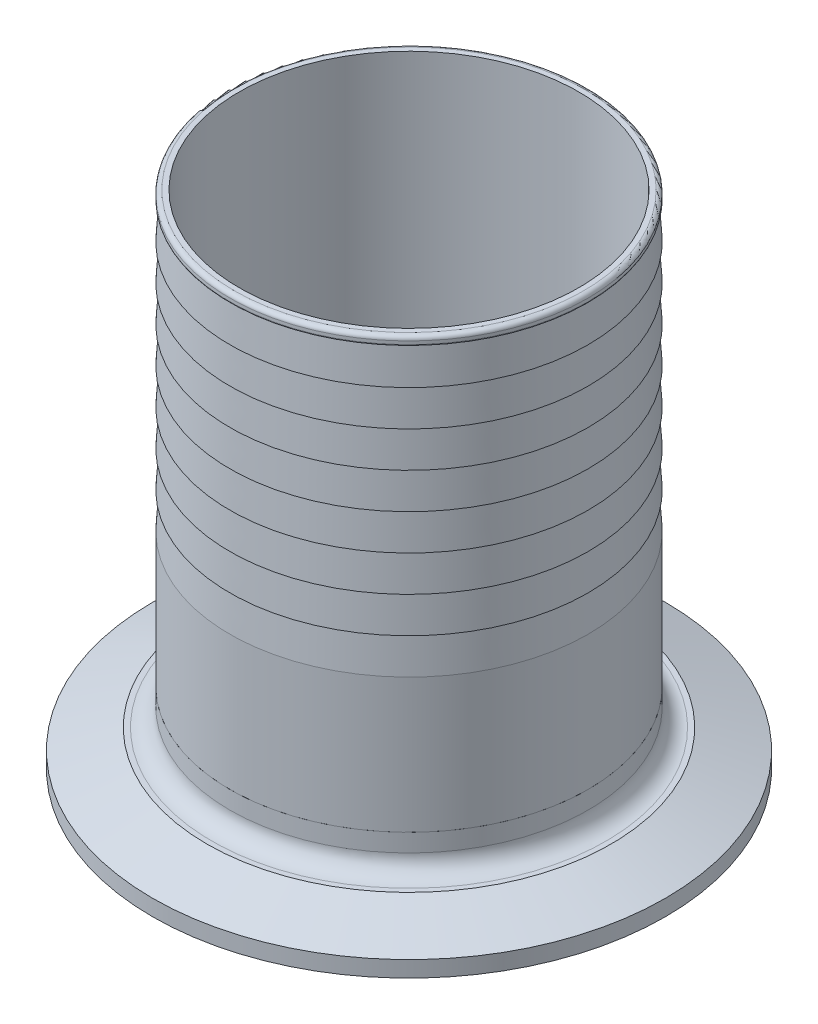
ISO-10303-21;
HEADER;
FILE_DESCRIPTION(('STEP AP214'),'2;1');
FILE_NAME('part.step','',(''),(''),'','','');
FILE_SCHEMA(('AUTOMOTIVE_DESIGN { 1 0 10303 214 1 1 1 1 }'));
ENDSEC;
DATA;
#1=APPLICATION_CONTEXT('core data for automotive mechanical design processes');
#2=APPLICATION_PROTOCOL_DEFINITION('international standard','automotive_design',2000,#1);
#3=PRODUCT_CONTEXT('',#1,'mechanical');
#4=PRODUCT('Part','Part','',(#3));
#5=PRODUCT_RELATED_PRODUCT_CATEGORY('part','',(#4));
#6=PRODUCT_DEFINITION_FORMATION('','',#4);
#7=PRODUCT_DEFINITION_CONTEXT('part definition',#1,'design');
#8=PRODUCT_DEFINITION('design','',#6,#7);
#9=PRODUCT_DEFINITION_SHAPE('','',#8);
#10=(LENGTH_UNIT() NAMED_UNIT(*) SI_UNIT(.MILLI.,.METRE.));
#11=(NAMED_UNIT(*) PLANE_ANGLE_UNIT() SI_UNIT($,.RADIAN.));
#12=(NAMED_UNIT(*) SI_UNIT($,.STERADIAN.) SOLID_ANGLE_UNIT());
#13=UNCERTAINTY_MEASURE_WITH_UNIT(LENGTH_MEASURE(1.E-05),#10,'distance_accuracy_value','');
#14=(GEOMETRIC_REPRESENTATION_CONTEXT(3) GLOBAL_UNCERTAINTY_ASSIGNED_CONTEXT((#13)) GLOBAL_UNIT_ASSIGNED_CONTEXT((#10,
#11,#12)) REPRESENTATION_CONTEXT('',''));
#15=CARTESIAN_POINT('',(0.,0.,0.));
#16=DIRECTION('',(0.,0.,1.));
#17=DIRECTION('',(1.,0.,0.));
#18=AXIS2_PLACEMENT_3D('',#15,#16,#17);
#19=CARTESIAN_POINT('',(78.5061436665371,55.9094907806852,58.4842656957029));
#20=DIRECTION('',(0.,-1.,0.));
#21=DIRECTION('',(-0.220180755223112,0.,-0.97545908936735));
#22=AXIS2_PLACEMENT_3D('',#19,#20,#21);
#23=PLANE('',#22);
#24=CARTESIAN_POINT('',(47.5353175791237,55.9094907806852,65.4750046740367));
#25=DIRECTION('',(0.,-1.,0.));
#26=DIRECTION('',(-0.220180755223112,0.,-0.97545908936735));
#27=AXIS2_PLACEMENT_3D('',#24,#25,#26);
#28=CIRCLE('',#27,30.099);
#29=CARTESIAN_POINT('',(40.9080970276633,55.9094907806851,36.1146615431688));
#30=VERTEX_POINT('',#29);
#31=EDGE_CURVE('P0_E85',#30,#30,#28,.T.);
#32=ORIENTED_EDGE('',*,*,#31,.F.);
#33=EDGE_LOOP('',(#32));
#34=FACE_BOUND('',#33,.T.);
#35=CARTESIAN_POINT('',(47.5353175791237,55.9094907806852,65.4750046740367));
#36=DIRECTION('',(0.,-1.,0.));
#37=DIRECTION('',(-0.220180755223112,0.,-0.97545908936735));
#38=AXIS2_PLACEMENT_3D('',#35,#36,#37);
#39=CIRCLE('',#38,31.75);
#40=CARTESIAN_POINT('',(40.5445786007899,55.9094907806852,34.5041785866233));
#41=VERTEX_POINT('',#40);
#42=EDGE_CURVE('P0_E9',#41,#41,#39,.T.);
#43=ORIENTED_EDGE('',*,*,#42,.T.);
#44=EDGE_LOOP('',(#43));
#45=FACE_BOUND('',#44,.T.);
#46=ADVANCED_FACE('P0_F14',(#34,#45),#23,.T.);
#47=CARTESIAN_POINT('',(47.5353175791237,55.9094907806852,65.4750046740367));
#48=DIRECTION('',(0.,-1.,0.));
#49=DIRECTION('',(-0.220180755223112,0.,-0.97545908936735));
#50=AXIS2_PLACEMENT_3D('',#47,#48,#49);
#51=CYLINDRICAL_SURFACE('',#50,31.75);
#52=CARTESIAN_POINT('',(47.5353175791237,79.7346907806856,65.4750046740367));
#53=DIRECTION('',(0.,-1.,0.));
#54=DIRECTION('',(-0.220180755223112,0.,-0.97545908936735));
#55=AXIS2_PLACEMENT_3D('',#52,#53,#54);
#56=CIRCLE('',#55,31.75);
#57=CARTESIAN_POINT('',(40.5445786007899,79.7346907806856,34.5041785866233));
#58=VERTEX_POINT('',#57);
#59=EDGE_CURVE('P0_E20',#58,#58,#56,.T.);
#60=ORIENTED_EDGE('',*,*,#59,.T.);
#61=EDGE_LOOP('',(#60));
#62=FACE_BOUND('',#61,.T.);
#63=ORIENTED_EDGE('',*,*,#42,.F.);
#64=EDGE_LOOP('',(#63));
#65=FACE_BOUND('',#64,.T.);
#66=ADVANCED_FACE('P0_F101',(#62,#65),#51,.T.);
#67=CARTESIAN_POINT('',(47.5353175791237,79.7346907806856,65.4750046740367));
#68=DIRECTION('',(0.,-1.,0.));
#69=DIRECTION('',(-0.220180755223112,0.,-0.97545908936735));
#70=AXIS2_PLACEMENT_3D('',#67,#68,#69);
#71=CONICAL_SURFACE('',#70,31.75,0.0599281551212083);
#72=CARTESIAN_POINT('',(47.5353175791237,86.0846907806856,65.4750046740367));
#73=DIRECTION('',(0.,-1.,0.));
#74=DIRECTION('',(-0.220180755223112,0.,-0.97545908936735));
#75=AXIS2_PLACEMENT_3D('',#72,#73,#74);
#76=CIRCLE('',#75,31.369);
#77=CARTESIAN_POINT('',(40.6284674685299,86.0846907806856,34.8758284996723));
#78=VERTEX_POINT('',#77);
#79=EDGE_CURVE('P0_E24',#78,#78,#76,.T.);
#80=ORIENTED_EDGE('',*,*,#79,.T.);
#81=EDGE_LOOP('',(#80));
#82=FACE_BOUND('',#81,.T.);
#83=ORIENTED_EDGE('',*,*,#59,.F.);
#84=EDGE_LOOP('',(#83));
#85=FACE_BOUND('',#84,.T.);
#86=ADVANCED_FACE('P0_F106',(#82,#85),#71,.T.);
#87=CARTESIAN_POINT('',(78.5061436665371,86.0846907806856,58.4842656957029));
#88=DIRECTION('',(0.,-1.,0.));
#89=DIRECTION('',(-0.220180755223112,0.,-0.97545908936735));
#90=AXIS2_PLACEMENT_3D('',#87,#88,#89);
#91=PLANE('',#90);
#92=CARTESIAN_POINT('',(47.5353175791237,86.0846907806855,65.4750046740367));
#93=DIRECTION('',(0.,-1.,0.));
#94=DIRECTION('',(-0.220180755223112,0.,-0.97545908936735));
#95=AXIS2_PLACEMENT_3D('',#92,#93,#94);
#96=CIRCLE('',#95,31.75);
#97=CARTESIAN_POINT('',(40.5445786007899,86.0846907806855,34.5041785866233));
#98=VERTEX_POINT('',#97);
#99=EDGE_CURVE('P0_E28',#98,#98,#96,.T.);
#100=ORIENTED_EDGE('',*,*,#99,.T.);
#101=EDGE_LOOP('',(#100));
#102=FACE_BOUND('',#101,.T.);
#103=ORIENTED_EDGE('',*,*,#79,.F.);
#104=EDGE_LOOP('',(#103));
#105=FACE_BOUND('',#104,.T.);
#106=ADVANCED_FACE('P0_F110',(#102,#105),#91,.T.);
#107=CARTESIAN_POINT('',(47.5353175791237,86.0846907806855,65.4750046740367));
#108=DIRECTION('',(0.,-1.,0.));
#109=DIRECTION('',(-0.220180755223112,0.,-0.97545908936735));
#110=AXIS2_PLACEMENT_3D('',#107,#108,#109);
#111=CONICAL_SURFACE('',#110,31.75,0.0599281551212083);
#112=CARTESIAN_POINT('',(47.5353175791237,92.4346907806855,65.4750046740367));
#113=DIRECTION('',(0.,-1.,0.));
#114=DIRECTION('',(-0.220180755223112,0.,-0.97545908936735));
#115=AXIS2_PLACEMENT_3D('',#112,#113,#114);
#116=CIRCLE('',#115,31.369);
#117=CARTESIAN_POINT('',(40.6284674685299,92.4346907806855,34.8758284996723));
#118=VERTEX_POINT('',#117);
#119=EDGE_CURVE('P0_E33',#118,#118,#116,.T.);
#120=ORIENTED_EDGE('',*,*,#119,.T.);
#121=EDGE_LOOP('',(#120));
#122=FACE_BOUND('',#121,.T.);
#123=ORIENTED_EDGE('',*,*,#99,.F.);
#124=EDGE_LOOP('',(#123));
#125=FACE_BOUND('',#124,.T.);
#126=ADVANCED_FACE('P0_F117',(#122,#125),#111,.T.);
#127=CARTESIAN_POINT('',(78.5061436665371,92.4346907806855,58.4842656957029));
#128=DIRECTION('',(0.,-1.,0.));
#129=DIRECTION('',(-0.220180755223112,0.,-0.97545908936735));
#130=AXIS2_PLACEMENT_3D('',#127,#128,#129);
#131=PLANE('',#130);
#132=CARTESIAN_POINT('',(47.5353175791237,92.4346907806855,65.4750046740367));
#133=DIRECTION('',(0.,-1.,0.));
#134=DIRECTION('',(-0.220180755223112,0.,-0.97545908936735));
#135=AXIS2_PLACEMENT_3D('',#132,#133,#134);
#136=CIRCLE('',#135,31.75);
#137=CARTESIAN_POINT('',(40.5445786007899,92.4346907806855,34.5041785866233));
#138=VERTEX_POINT('',#137);
#139=EDGE_CURVE('P0_E36',#138,#138,#136,.T.);
#140=ORIENTED_EDGE('',*,*,#139,.T.);
#141=EDGE_LOOP('',(#140));
#142=FACE_BOUND('',#141,.T.);
#143=ORIENTED_EDGE('',*,*,#119,.F.);
#144=EDGE_LOOP('',(#143));
#145=FACE_BOUND('',#144,.T.);
#146=ADVANCED_FACE('P0_F121',(#142,#145),#131,.T.);
#147=CARTESIAN_POINT('',(47.5353175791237,92.4346907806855,65.4750046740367));
#148=DIRECTION('',(0.,-1.,0.));
#149=DIRECTION('',(-0.220180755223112,0.,-0.97545908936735));
#150=AXIS2_PLACEMENT_3D('',#147,#148,#149);
#151=CONICAL_SURFACE('',#150,31.75,0.0599281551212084);
#152=CARTESIAN_POINT('',(47.5353175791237,98.7846907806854,65.4750046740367));
#153=DIRECTION('',(0.,-1.,0.));
#154=DIRECTION('',(-0.220180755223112,0.,-0.97545908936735));
#155=AXIS2_PLACEMENT_3D('',#152,#153,#154);
#156=CIRCLE('',#155,31.369);
#157=CARTESIAN_POINT('',(40.6284674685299,98.7846907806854,34.8758284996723));
#158=VERTEX_POINT('',#157);
#159=EDGE_CURVE('P0_E39',#158,#158,#156,.T.);
#160=ORIENTED_EDGE('',*,*,#159,.T.);
#161=EDGE_LOOP('',(#160));
#162=FACE_BOUND('',#161,.T.);
#163=ORIENTED_EDGE('',*,*,#139,.F.);
#164=EDGE_LOOP('',(#163));
#165=FACE_BOUND('',#164,.T.);
#166=ADVANCED_FACE('P0_F125',(#162,#165),#151,.T.);
#167=CARTESIAN_POINT('',(78.506143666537,98.7846907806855,58.4842656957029));
#168=DIRECTION('',(0.,-1.,0.));
#169=DIRECTION('',(-0.220180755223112,0.,-0.97545908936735));
#170=AXIS2_PLACEMENT_3D('',#167,#168,#169);
#171=PLANE('',#170);
#172=CARTESIAN_POINT('',(47.5353175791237,98.7846907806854,65.4750046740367));
#173=DIRECTION('',(0.,-1.,0.));
#174=DIRECTION('',(-0.220180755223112,0.,-0.97545908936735));
#175=AXIS2_PLACEMENT_3D('',#172,#173,#174);
#176=CIRCLE('',#175,31.75);
#177=CARTESIAN_POINT('',(40.5445786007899,98.7846907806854,34.5041785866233));
#178=VERTEX_POINT('',#177);
#179=EDGE_CURVE('P0_E42',#178,#178,#176,.T.);
#180=ORIENTED_EDGE('',*,*,#179,.T.);
#181=EDGE_LOOP('',(#180));
#182=FACE_BOUND('',#181,.T.);
#183=ORIENTED_EDGE('',*,*,#159,.F.);
#184=EDGE_LOOP('',(#183));
#185=FACE_BOUND('',#184,.T.);
#186=ADVANCED_FACE('P0_F129',(#182,#185),#171,.T.);
#187=CARTESIAN_POINT('',(47.5353175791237,98.7846907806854,65.4750046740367));
#188=DIRECTION('',(0.,-1.,0.));
#189=DIRECTION('',(-0.220180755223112,0.,-0.97545908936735));
#190=AXIS2_PLACEMENT_3D('',#187,#188,#189);
#191=CONICAL_SURFACE('',#190,31.75,0.0599281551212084);
#192=CARTESIAN_POINT('',(47.5353175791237,105.134690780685,65.4750046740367));
#193=DIRECTION('',(0.,-1.,0.));
#194=DIRECTION('',(-0.220180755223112,0.,-0.97545908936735));
#195=AXIS2_PLACEMENT_3D('',#192,#193,#194);
#196=CIRCLE('',#195,31.369);
#197=CARTESIAN_POINT('',(40.6284674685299,105.134690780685,34.8758284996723));
#198=VERTEX_POINT('',#197);
#199=EDGE_CURVE('P0_E45',#198,#198,#196,.T.);
#200=ORIENTED_EDGE('',*,*,#199,.T.);
#201=EDGE_LOOP('',(#200));
#202=FACE_BOUND('',#201,.T.);
#203=ORIENTED_EDGE('',*,*,#179,.F.);
#204=EDGE_LOOP('',(#203));
#205=FACE_BOUND('',#204,.T.);
#206=ADVANCED_FACE('P0_F133',(#202,#205),#191,.T.);
#207=CARTESIAN_POINT('',(78.506143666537,105.134690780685,58.4842656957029));
#208=DIRECTION('',(0.,-1.,0.));
#209=DIRECTION('',(-0.220180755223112,0.,-0.97545908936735));
#210=AXIS2_PLACEMENT_3D('',#207,#208,#209);
#211=PLANE('',#210);
#212=CARTESIAN_POINT('',(47.5353175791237,105.134690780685,65.4750046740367));
#213=DIRECTION('',(0.,-1.,0.));
#214=DIRECTION('',(-0.220180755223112,0.,-0.97545908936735));
#215=AXIS2_PLACEMENT_3D('',#212,#213,#214);
#216=CIRCLE('',#215,31.75);
#217=CARTESIAN_POINT('',(40.5445786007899,105.134690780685,34.5041785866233));
#218=VERTEX_POINT('',#217);
#219=EDGE_CURVE('P0_E48',#218,#218,#216,.T.);
#220=ORIENTED_EDGE('',*,*,#219,.T.);
#221=EDGE_LOOP('',(#220));
#222=FACE_BOUND('',#221,.T.);
#223=ORIENTED_EDGE('',*,*,#199,.F.);
#224=EDGE_LOOP('',(#223));
#225=FACE_BOUND('',#224,.T.);
#226=ADVANCED_FACE('P0_F137',(#222,#225),#211,.T.);
#227=CARTESIAN_POINT('',(47.5353175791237,105.134690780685,65.4750046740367));
#228=DIRECTION('',(0.,-1.,0.));
#229=DIRECTION('',(-0.220180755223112,0.,-0.97545908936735));
#230=AXIS2_PLACEMENT_3D('',#227,#228,#229);
#231=CONICAL_SURFACE('',#230,31.75,0.0599281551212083);
#232=CARTESIAN_POINT('',(47.5353175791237,111.484690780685,65.4750046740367));
#233=DIRECTION('',(0.,-1.,0.));
#234=DIRECTION('',(-0.220180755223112,0.,-0.97545908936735));
#235=AXIS2_PLACEMENT_3D('',#232,#233,#234);
#236=CIRCLE('',#235,31.369);
#237=CARTESIAN_POINT('',(40.6284674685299,111.484690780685,34.8758284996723));
#238=VERTEX_POINT('',#237);
#239=EDGE_CURVE('P0_E51',#238,#238,#236,.T.);
#240=ORIENTED_EDGE('',*,*,#239,.T.);
#241=EDGE_LOOP('',(#240));
#242=FACE_BOUND('',#241,.T.);
#243=ORIENTED_EDGE('',*,*,#219,.F.);
#244=EDGE_LOOP('',(#243));
#245=FACE_BOUND('',#244,.T.);
#246=ADVANCED_FACE('P0_F141',(#242,#245),#231,.T.);
#247=CARTESIAN_POINT('',(78.506143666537,111.484690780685,58.4842656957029));
#248=DIRECTION('',(0.,-1.,0.));
#249=DIRECTION('',(-0.220180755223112,0.,-0.97545908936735));
#250=AXIS2_PLACEMENT_3D('',#247,#248,#249);
#251=PLANE('',#250);
#252=CARTESIAN_POINT('',(47.5353175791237,111.484690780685,65.4750046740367));
#253=DIRECTION('',(0.,-1.,0.));
#254=DIRECTION('',(-0.220180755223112,0.,-0.97545908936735));
#255=AXIS2_PLACEMENT_3D('',#252,#253,#254);
#256=CIRCLE('',#255,31.75);
#257=CARTESIAN_POINT('',(40.5445786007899,111.484690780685,34.5041785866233));
#258=VERTEX_POINT('',#257);
#259=EDGE_CURVE('P0_E54',#258,#258,#256,.T.);
#260=ORIENTED_EDGE('',*,*,#259,.T.);
#261=EDGE_LOOP('',(#260));
#262=FACE_BOUND('',#261,.T.);
#263=ORIENTED_EDGE('',*,*,#239,.F.);
#264=EDGE_LOOP('',(#263));
#265=FACE_BOUND('',#264,.T.);
#266=ADVANCED_FACE('P0_F145',(#262,#265),#251,.T.);
#267=CARTESIAN_POINT('',(47.5353175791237,111.484690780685,65.4750046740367));
#268=DIRECTION('',(0.,-1.,0.));
#269=DIRECTION('',(-0.220180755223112,0.,-0.97545908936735));
#270=AXIS2_PLACEMENT_3D('',#267,#268,#269);
#271=CONICAL_SURFACE('',#270,31.75,0.0599281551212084);
#272=CARTESIAN_POINT('',(47.5353175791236,117.834690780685,65.4750046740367));
#273=DIRECTION('',(0.,-1.,0.));
#274=DIRECTION('',(-0.220180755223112,0.,-0.97545908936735));
#275=AXIS2_PLACEMENT_3D('',#272,#273,#274);
#276=CIRCLE('',#275,31.369);
#277=CARTESIAN_POINT('',(40.6284674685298,117.834690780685,34.8758284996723));
#278=VERTEX_POINT('',#277);
#279=EDGE_CURVE('P0_E57',#278,#278,#276,.T.);
#280=ORIENTED_EDGE('',*,*,#279,.T.);
#281=EDGE_LOOP('',(#280));
#282=FACE_BOUND('',#281,.T.);
#283=ORIENTED_EDGE('',*,*,#259,.F.);
#284=EDGE_LOOP('',(#283));
#285=FACE_BOUND('',#284,.T.);
#286=ADVANCED_FACE('P0_F149',(#282,#285),#271,.T.);
#287=CARTESIAN_POINT('',(78.506143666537,117.834690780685,58.4842656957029));
#288=DIRECTION('',(0.,-1.,0.));
#289=DIRECTION('',(-0.220180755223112,0.,-0.97545908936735));
#290=AXIS2_PLACEMENT_3D('',#287,#288,#289);
#291=PLANE('',#290);
#292=CARTESIAN_POINT('',(47.5353175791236,117.834690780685,65.4750046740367));
#293=DIRECTION('',(0.,-1.,0.));
#294=DIRECTION('',(-0.220180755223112,0.,-0.97545908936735));
#295=AXIS2_PLACEMENT_3D('',#292,#293,#294);
#296=CIRCLE('',#295,31.75);
#297=CARTESIAN_POINT('',(40.5445786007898,117.834690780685,34.5041785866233));
#298=VERTEX_POINT('',#297);
#299=EDGE_CURVE('P0_E60',#298,#298,#296,.T.);
#300=ORIENTED_EDGE('',*,*,#299,.T.);
#301=EDGE_LOOP('',(#300));
#302=FACE_BOUND('',#301,.T.);
#303=ORIENTED_EDGE('',*,*,#279,.F.);
#304=EDGE_LOOP('',(#303));
#305=FACE_BOUND('',#304,.T.);
#306=ADVANCED_FACE('P0_F153',(#302,#305),#291,.T.);
#307=CARTESIAN_POINT('',(47.5353175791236,117.834690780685,65.4750046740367));
#308=DIRECTION('',(0.,-1.,0.));
#309=DIRECTION('',(-0.220180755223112,0.,-0.97545908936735));
#310=AXIS2_PLACEMENT_3D('',#307,#308,#309);
#311=CONICAL_SURFACE('',#310,31.75,0.0599281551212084);
#312=CARTESIAN_POINT('',(47.5353175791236,124.184690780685,65.4750046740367));
#313=DIRECTION('',(0.,-1.,0.));
#314=DIRECTION('',(-0.220180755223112,0.,-0.97545908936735));
#315=AXIS2_PLACEMENT_3D('',#312,#313,#314);
#316=CIRCLE('',#315,31.369);
#317=CARTESIAN_POINT('',(40.6284674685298,124.184690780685,34.8758284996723));
#318=VERTEX_POINT('',#317);
#319=EDGE_CURVE('P0_E63',#318,#318,#316,.T.);
#320=ORIENTED_EDGE('',*,*,#319,.T.);
#321=EDGE_LOOP('',(#320));
#322=FACE_BOUND('',#321,.T.);
#323=ORIENTED_EDGE('',*,*,#299,.F.);
#324=EDGE_LOOP('',(#323));
#325=FACE_BOUND('',#324,.T.);
#326=ADVANCED_FACE('P0_F157',(#322,#325),#311,.T.);
#327=CARTESIAN_POINT('',(78.506143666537,124.184690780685,58.4842656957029));
#328=DIRECTION('',(0.,-1.,0.));
#329=DIRECTION('',(-0.220180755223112,0.,-0.97545908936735));
#330=AXIS2_PLACEMENT_3D('',#327,#328,#329);
#331=PLANE('',#330);
#332=CARTESIAN_POINT('',(47.5353175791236,124.184690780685,65.4750046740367));
#333=DIRECTION('',(0.,-1.,0.));
#334=DIRECTION('',(-0.220180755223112,0.,-0.97545908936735));
#335=AXIS2_PLACEMENT_3D('',#332,#333,#334);
#336=CIRCLE('',#335,31.75);
#337=CARTESIAN_POINT('',(40.5445786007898,124.184690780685,34.5041785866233));
#338=VERTEX_POINT('',#337);
#339=EDGE_CURVE('P0_E66',#338,#338,#336,.T.);
#340=ORIENTED_EDGE('',*,*,#339,.T.);
#341=EDGE_LOOP('',(#340));
#342=FACE_BOUND('',#341,.T.);
#343=ORIENTED_EDGE('',*,*,#319,.F.);
#344=EDGE_LOOP('',(#343));
#345=FACE_BOUND('',#344,.T.);
#346=ADVANCED_FACE('P0_F161',(#342,#345),#331,.T.);
#347=CARTESIAN_POINT('',(47.5353175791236,124.184690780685,65.4750046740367));
#348=DIRECTION('',(0.,-1.,0.));
#349=DIRECTION('',(-0.220180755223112,0.,-0.97545908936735));
#350=AXIS2_PLACEMENT_3D('',#347,#348,#349);
#351=CONICAL_SURFACE('',#350,31.75,0.0599281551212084);
#352=CARTESIAN_POINT('',(47.5353175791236,130.534690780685,65.4750046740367));
#353=DIRECTION('',(0.,-1.,0.));
#354=DIRECTION('',(-0.220180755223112,0.,-0.97545908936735));
#355=AXIS2_PLACEMENT_3D('',#352,#353,#354);
#356=CIRCLE('',#355,31.369);
#357=CARTESIAN_POINT('',(40.6284674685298,130.534690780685,34.8758284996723));
#358=VERTEX_POINT('',#357);
#359=EDGE_CURVE('P0_E69',#358,#358,#356,.T.);
#360=ORIENTED_EDGE('',*,*,#359,.T.);
#361=EDGE_LOOP('',(#360));
#362=FACE_BOUND('',#361,.T.);
#363=ORIENTED_EDGE('',*,*,#339,.F.);
#364=EDGE_LOOP('',(#363));
#365=FACE_BOUND('',#364,.T.);
#366=ADVANCED_FACE('P0_F165',(#362,#365),#351,.T.);
#367=CARTESIAN_POINT('',(78.2583770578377,130.534690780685,58.5401916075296));
#368=DIRECTION('',(0.,-1.,0.));
#369=DIRECTION('',(-0.220180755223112,0.,-0.97545908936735));
#370=AXIS2_PLACEMENT_3D('',#367,#368,#369);
#371=PLANE('',#370);
#372=CARTESIAN_POINT('',(47.5353175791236,130.534690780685,65.4750046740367));
#373=DIRECTION('',(0.,-1.,0.));
#374=DIRECTION('',(-0.220180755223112,0.,-0.97545908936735));
#375=AXIS2_PLACEMENT_3D('',#372,#373,#374);
#376=CIRCLE('',#375,31.496);
#377=CARTESIAN_POINT('',(40.6005045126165,130.534690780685,34.7519451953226));
#378=VERTEX_POINT('',#377);
#379=EDGE_CURVE('P0_E72',#378,#378,#376,.T.);
#380=ORIENTED_EDGE('',*,*,#379,.T.);
#381=EDGE_LOOP('',(#380));
#382=FACE_BOUND('',#381,.T.);
#383=ORIENTED_EDGE('',*,*,#359,.F.);
#384=EDGE_LOOP('',(#383));
#385=FACE_BOUND('',#384,.T.);
#386=ADVANCED_FACE('P0_F169',(#382,#385),#371,.T.);
#387=CARTESIAN_POINT('',(47.5353175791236,130.788690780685,65.4750046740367));
#388=DIRECTION('',(0.,-1.,0.));
#389=DIRECTION('',(-0.220180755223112,0.,-0.97545908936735));
#390=AXIS2_PLACEMENT_3D('',#387,#388,#389);
#391=TOROIDAL_SURFACE('',#390,31.496,0.254000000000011);
#392=CARTESIAN_POINT('',(47.5353175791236,130.788690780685,65.4750046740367));
#393=DIRECTION('',(0.,-1.,0.));
#394=DIRECTION('',(-0.220180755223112,0.,-0.97545908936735));
#395=AXIS2_PLACEMENT_3D('',#392,#393,#394);
#396=CIRCLE('',#395,31.75);
#397=CARTESIAN_POINT('',(40.5445786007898,130.788690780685,34.5041785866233));
#398=VERTEX_POINT('',#397);
#399=EDGE_CURVE('P0_E75',#398,#398,#396,.T.);
#400=ORIENTED_EDGE('',*,*,#399,.T.);
#401=EDGE_LOOP('',(#400));
#402=FACE_BOUND('',#401,.T.);
#403=ORIENTED_EDGE('',*,*,#379,.F.);
#404=EDGE_LOOP('',(#403));
#405=FACE_BOUND('',#404,.T.);
#406=ADVANCED_FACE('P0_F173',(#402,#405),#391,.T.);
#407=CARTESIAN_POINT('',(47.5353175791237,55.9094907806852,65.4750046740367));
#408=DIRECTION('',(0.,-1.,0.));
#409=DIRECTION('',(-0.220180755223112,0.,-0.97545908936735));
#410=AXIS2_PLACEMENT_3D('',#407,#408,#409);
#411=CYLINDRICAL_SURFACE('',#410,31.75);
#412=CARTESIAN_POINT('',(47.5353175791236,131.347490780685,65.4750046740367));
#413=DIRECTION('',(0.,-1.,0.));
#414=DIRECTION('',(-0.220180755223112,0.,-0.97545908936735));
#415=AXIS2_PLACEMENT_3D('',#412,#413,#414);
#416=CIRCLE('',#415,31.75);
#417=CARTESIAN_POINT('',(40.5445786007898,131.347490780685,34.5041785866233));
#418=VERTEX_POINT('',#417);
#419=EDGE_CURVE('P0_E78',#418,#418,#416,.T.);
#420=ORIENTED_EDGE('',*,*,#419,.T.);
#421=EDGE_LOOP('',(#420));
#422=FACE_BOUND('',#421,.T.);
#423=ORIENTED_EDGE('',*,*,#399,.F.);
#424=EDGE_LOOP('',(#423));
#425=FACE_BOUND('',#424,.T.);
#426=ADVANCED_FACE('P0_F177',(#422,#425),#411,.T.);
#427=CARTESIAN_POINT('',(47.5353175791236,131.347490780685,65.4750046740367));
#428=DIRECTION('',(0.,-1.,0.));
#429=DIRECTION('',(-0.220180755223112,0.,-0.97545908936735));
#430=AXIS2_PLACEMENT_3D('',#427,#428,#429);
#431=TOROIDAL_SURFACE('',#430,30.988,0.761999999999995);
#432=CARTESIAN_POINT('',(47.5353175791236,132.109490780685,65.4750046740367));
#433=DIRECTION('',(0.,-1.,0.));
#434=DIRECTION('',(-0.220180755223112,0.,-0.97545908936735));
#435=AXIS2_PLACEMENT_3D('',#432,#433,#434);
#436=CIRCLE('',#435,30.988);
#437=CARTESIAN_POINT('',(40.7123563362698,132.109490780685,35.2474784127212));
#438=VERTEX_POINT('',#437);
#439=EDGE_CURVE('P0_E81',#438,#438,#436,.T.);
#440=ORIENTED_EDGE('',*,*,#439,.T.);
#441=EDGE_LOOP('',(#440));
#442=FACE_BOUND('',#441,.T.);
#443=ORIENTED_EDGE('',*,*,#419,.F.);
#444=EDGE_LOOP('',(#443));
#445=FACE_BOUND('',#444,.T.);
#446=ADVANCED_FACE('P0_F181',(#442,#445),#431,.T.);
#447=CARTESIAN_POINT('',(47.5353175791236,132.109490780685,65.4750046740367));
#448=DIRECTION('',(0.,1.,0.));
#449=DIRECTION('',(0.220180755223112,0.,0.97545908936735));
#450=AXIS2_PLACEMENT_3D('',#447,#448,#449);
#451=PLANE('',#450);
#452=CARTESIAN_POINT('',(47.5353175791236,132.109490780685,65.4750046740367));
#453=DIRECTION('',(0.,-1.,0.));
#454=DIRECTION('',(-0.220180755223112,0.,-0.97545908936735));
#455=AXIS2_PLACEMENT_3D('',#452,#453,#454);
#456=CIRCLE('',#455,30.099);
#457=CARTESIAN_POINT('',(40.9080970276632,132.109490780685,36.1146615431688));
#458=VERTEX_POINT('',#457);
#459=EDGE_CURVE('P0_E84',#458,#458,#456,.T.);
#460=ORIENTED_EDGE('',*,*,#459,.T.);
#461=EDGE_LOOP('',(#460));
#462=FACE_BOUND('',#461,.T.);
#463=ORIENTED_EDGE('',*,*,#439,.F.);
#464=EDGE_LOOP('',(#463));
#465=FACE_BOUND('',#464,.T.);
#466=ADVANCED_FACE('P0_F91',(#462,#465),#451,.T.);
#467=CARTESIAN_POINT('',(47.5353175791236,132.109490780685,65.4750046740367));
#468=DIRECTION('',(0.,-1.,0.));
#469=DIRECTION('',(-0.220180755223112,0.,-0.97545908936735));
#470=AXIS2_PLACEMENT_3D('',#467,#468,#469);
#471=CYLINDRICAL_SURFACE('',#470,30.099);
#472=CARTESIAN_POINT('',(40.9080970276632,132.109490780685,36.1146615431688));
#473=CARTESIAN_POINT('',(40.9080970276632,131.315740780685,36.1146615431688));
#474=CARTESIAN_POINT('',(40.9080970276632,130.521990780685,36.1146615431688));
#475=CARTESIAN_POINT('',(40.9080970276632,128.934490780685,36.1146615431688));
#476=CARTESIAN_POINT('',(40.9080970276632,128.140740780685,36.1146615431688));
#477=CARTESIAN_POINT('',(40.9080970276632,126.553240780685,36.1146615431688));
#478=CARTESIAN_POINT('',(40.9080970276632,125.759490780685,36.1146615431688));
#479=CARTESIAN_POINT('',(40.9080970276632,124.171990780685,36.1146615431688));
#480=CARTESIAN_POINT('',(40.9080970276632,123.378240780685,36.1146615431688));
#481=CARTESIAN_POINT('',(40.9080970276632,121.790740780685,36.1146615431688));
#482=CARTESIAN_POINT('',(40.9080970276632,120.996990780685,36.1146615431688));
#483=CARTESIAN_POINT('',(40.9080970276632,119.409490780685,36.1146615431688));
#484=CARTESIAN_POINT('',(40.9080970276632,118.615740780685,36.1146615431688));
#485=CARTESIAN_POINT('',(40.9080970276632,117.028240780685,36.1146615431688));
#486=CARTESIAN_POINT('',(40.9080970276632,116.234490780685,36.1146615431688));
#487=CARTESIAN_POINT('',(40.9080970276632,114.646990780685,36.1146615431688));
#488=CARTESIAN_POINT('',(40.9080970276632,113.853240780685,36.1146615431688));
#489=CARTESIAN_POINT('',(40.9080970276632,112.265740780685,36.1146615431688));
#490=CARTESIAN_POINT('',(40.9080970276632,111.471990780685,36.1146615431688));
#491=CARTESIAN_POINT('',(40.9080970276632,109.884490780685,36.1146615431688));
#492=CARTESIAN_POINT('',(40.9080970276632,109.090740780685,36.1146615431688));
#493=CARTESIAN_POINT('',(40.9080970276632,107.503240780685,36.1146615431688));
#494=CARTESIAN_POINT('',(40.9080970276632,106.709490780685,36.1146615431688));
#495=CARTESIAN_POINT('',(40.9080970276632,105.121990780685,36.1146615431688));
#496=CARTESIAN_POINT('',(40.9080970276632,104.328240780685,36.1146615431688));
#497=CARTESIAN_POINT('',(40.9080970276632,102.740740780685,36.1146615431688));
#498=CARTESIAN_POINT('',(40.9080970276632,101.946990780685,36.1146615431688));
#499=CARTESIAN_POINT('',(40.9080970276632,100.359490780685,36.1146615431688));
#500=CARTESIAN_POINT('',(40.9080970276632,99.5657407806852,36.1146615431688));
#501=CARTESIAN_POINT('',(40.9080970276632,97.9782407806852,36.1146615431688));
#502=CARTESIAN_POINT('',(40.9080970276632,97.1844907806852,36.1146615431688));
#503=CARTESIAN_POINT('',(40.9080970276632,95.5969907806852,36.1146615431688));
#504=CARTESIAN_POINT('',(40.9080970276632,94.8032407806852,36.1146615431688));
#505=CARTESIAN_POINT('',(40.9080970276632,93.2157407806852,36.1146615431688));
#506=CARTESIAN_POINT('',(40.9080970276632,92.4219907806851,36.1146615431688));
#507=CARTESIAN_POINT('',(40.9080970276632,90.8344907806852,36.1146615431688));
#508=CARTESIAN_POINT('',(40.9080970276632,90.0407407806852,36.1146615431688));
#509=CARTESIAN_POINT('',(40.9080970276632,88.4532407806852,36.1146615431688));
#510=CARTESIAN_POINT('',(40.9080970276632,87.6594907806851,36.1146615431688));
#511=CARTESIAN_POINT('',(40.9080970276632,86.0719907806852,36.1146615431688));
#512=CARTESIAN_POINT('',(40.9080970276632,85.2782407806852,36.1146615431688));
#513=CARTESIAN_POINT('',(40.9080970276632,83.6907407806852,36.1146615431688));
#514=CARTESIAN_POINT('',(40.9080970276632,82.8969907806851,36.1146615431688));
#515=CARTESIAN_POINT('',(40.9080970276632,81.3094907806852,36.1146615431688));
#516=CARTESIAN_POINT('',(40.9080970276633,80.5157407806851,36.1146615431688));
#517=CARTESIAN_POINT('',(40.9080970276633,78.9282407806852,36.1146615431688));
#518=CARTESIAN_POINT('',(40.9080970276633,78.1344907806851,36.1146615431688));
#519=CARTESIAN_POINT('',(40.9080970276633,76.5469907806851,36.1146615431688));
#520=CARTESIAN_POINT('',(40.9080970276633,75.7532407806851,36.1146615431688));
#521=CARTESIAN_POINT('',(40.9080970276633,74.1657407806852,36.1146615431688));
#522=CARTESIAN_POINT('',(40.9080970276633,73.3719907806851,36.1146615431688));
#523=CARTESIAN_POINT('',(40.9080970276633,71.7844907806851,36.1146615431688));
#524=CARTESIAN_POINT('',(40.9080970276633,70.9907407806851,36.1146615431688));
#525=CARTESIAN_POINT('',(40.9080970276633,69.4032407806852,36.1146615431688));
#526=CARTESIAN_POINT('',(40.9080970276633,68.6094907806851,36.1146615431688));
#527=CARTESIAN_POINT('',(40.9080970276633,67.0219907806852,36.1146615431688));
#528=CARTESIAN_POINT('',(40.9080970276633,66.2282407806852,36.1146615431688));
#529=CARTESIAN_POINT('',(40.9080970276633,64.6407407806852,36.1146615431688));
#530=CARTESIAN_POINT('',(40.9080970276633,63.8469907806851,36.1146615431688));
#531=CARTESIAN_POINT('',(40.9080970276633,62.2594907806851,36.1146615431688));
#532=CARTESIAN_POINT('',(40.9080970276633,61.4657407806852,36.1146615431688));
#533=CARTESIAN_POINT('',(40.9080970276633,59.8782407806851,36.1146615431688));
#534=CARTESIAN_POINT('',(40.9080970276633,59.0844907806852,36.1146615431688));
#535=CARTESIAN_POINT('',(40.9080970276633,57.4969907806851,36.1146615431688));
#536=CARTESIAN_POINT('',(40.9080970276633,56.7032407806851,36.1146615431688));
#537=CARTESIAN_POINT('',(40.9080970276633,55.9094907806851,36.1146615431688));
#538=B_SPLINE_CURVE_WITH_KNOTS('',3,(#472,#473,#474,#475,#476,#477,#478,#479,#480,#481,#482,
#483,#484,#485,#486,#487,#488,#489,#490,#491,#492,#493,#494,#495,#496,#497,#498,#499,#500,#501,
#502,#503,#504,#505,#506,#507,#508,#509,#510,#511,#512,#513,#514,#515,#516,#517,#518,#519,#520,
#521,#522,#523,#524,#525,#526,#527,#528,#529,#530,#531,#532,#533,#534,#535,#536,#537),
.UNSPECIFIED.,.F.,.F.,(4,2,2,2,2,2,2,2,2,2,2,2,2,2,2,2,2,2,2,2,2,2,2,2,2,2,2,2,2,2,2,2,4),(0.,
2.38125,4.7625,7.14375000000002,9.52500000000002,11.90625,14.2875,16.66875,19.05,21.43125,
23.8125,26.19375,28.575,30.95625,33.3375,35.71875,38.1,40.48125,42.8625,45.24375,47.625,
50.00625,52.3875,54.76875,57.15,59.53125,61.9125,64.29375,66.675,69.05625,71.4375,73.81875,
76.2),.UNSPECIFIED.);
#539=EDGE_CURVE('P0_BSEAM94',#458,#30,#538,.T.);
#540=ORIENTED_EDGE('',*,*,#459,.F.);
#541=ORIENTED_EDGE('',*,*,#31,.T.);
#542=ORIENTED_EDGE('',*,*,#539,.T.);
#543=ORIENTED_EDGE('',*,*,#539,.F.);
#544=EDGE_LOOP('',(#540,#542,#541,#543));
#545=FACE_BOUND('',#544,.T.);
#546=ADVANCED_FACE('P0_F94',(#545),#471,.F.);
#547=CLOSED_SHELL('',(#46,#66,#86,#106,#126,#146,#166,#186,#206,#226,#246,#266,#286,#306,#326,
#346,#366,#386,#406,#426,#446,#466,#546));
#548=MANIFOLD_SOLID_BREP('P0_B1',#547);
#549=CARTESIAN_POINT('',(17.4363175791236,55.9094907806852,65.4750046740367));
#550=DIRECTION('',(0.,-1.,0.));
#551=DIRECTION('',(0.,0.,-1.));
#552=AXIS2_PLACEMENT_3D('',#549,#550,#551);
#553=PLANE('',#552);
#554=CARTESIAN_POINT('',(47.5353175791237,55.9094907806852,65.4750046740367));
#555=DIRECTION('',(0.,-1.,0.));
#556=DIRECTION('',(0.,0.,-1.));
#557=AXIS2_PLACEMENT_3D('',#554,#555,#556);
#558=CIRCLE('',#557,31.75);
#559=CARTESIAN_POINT('',(47.5353175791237,55.9094907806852,33.7250046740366));
#560=VERTEX_POINT('',#559);
#561=EDGE_CURVE('P1_E10',#560,#560,#558,.T.);
#562=ORIENTED_EDGE('',*,*,#561,.F.);
#563=EDGE_LOOP('',(#562));
#564=FACE_BOUND('',#563,.T.);
#565=CARTESIAN_POINT('',(47.5353175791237,55.9094907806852,65.4750046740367));
#566=DIRECTION('',(0.,-1.,0.));
#567=DIRECTION('',(0.,0.,-1.));
#568=AXIS2_PLACEMENT_3D('',#565,#566,#567);
#569=CIRCLE('',#568,30.099);
#570=CARTESIAN_POINT('',(47.5353175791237,55.9094907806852,35.3760046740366));
#571=VERTEX_POINT('',#570);
#572=EDGE_CURVE('P1_E64',#571,#571,#569,.T.);
#573=ORIENTED_EDGE('',*,*,#572,.T.);
#574=EDGE_LOOP('',(#573));
#575=FACE_BOUND('',#574,.T.);
#576=ADVANCED_FACE('P1_F15',(#564,#575),#553,.F.);
#577=CARTESIAN_POINT('',(47.5353175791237,43.2094907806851,65.4750046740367));
#578=DIRECTION('',(0.,-1.,0.));
#579=DIRECTION('',(0.,0.,-1.));
#580=AXIS2_PLACEMENT_3D('',#577,#578,#579);
#581=CYLINDRICAL_SURFACE('',#580,31.75);
#582=CARTESIAN_POINT('',(47.5353175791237,52.7344907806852,65.4750046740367));
#583=DIRECTION('',(0.,-1.,0.));
#584=DIRECTION('',(0.,0.,-1.));
#585=AXIS2_PLACEMENT_3D('',#582,#583,#584);
#586=CIRCLE('',#585,31.75);
#587=CARTESIAN_POINT('',(47.5353175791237,52.7344907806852,33.7250046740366));
#588=VERTEX_POINT('',#587);
#589=EDGE_CURVE('P1_E21',#588,#588,#586,.T.);
#590=ORIENTED_EDGE('',*,*,#589,.F.);
#591=EDGE_LOOP('',(#590));
#592=FACE_BOUND('',#591,.T.);
#593=ORIENTED_EDGE('',*,*,#561,.T.);
#594=EDGE_LOOP('',(#593));
#595=FACE_BOUND('',#594,.T.);
#596=ADVANCED_FACE('P1_F143',(#592,#595),#581,.T.);
#597=CARTESIAN_POINT('',(47.5353175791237,52.7344907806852,65.4750046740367));
#598=DIRECTION('',(0.,-1.,0.));
#599=DIRECTION('',(0.,0.,-1.));
#600=AXIS2_PLACEMENT_3D('',#597,#598,#599);
#601=TOROIDAL_SURFACE('',#600,34.925,3.175);
#602=CARTESIAN_POINT('',(47.5353175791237,49.5594907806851,65.4750046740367));
#603=DIRECTION('',(0.,-1.,0.));
#604=DIRECTION('',(0.,0.,-1.));
#605=AXIS2_PLACEMENT_3D('',#602,#603,#604);
#606=CIRCLE('',#605,34.925);
#607=CARTESIAN_POINT('',(47.5353175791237,49.5594907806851,30.5500046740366));
#608=VERTEX_POINT('',#607);
#609=EDGE_CURVE('P1_E25',#608,#608,#606,.T.);
#610=ORIENTED_EDGE('',*,*,#609,.F.);
#611=EDGE_LOOP('',(#610));
#612=FACE_BOUND('',#611,.T.);
#613=ORIENTED_EDGE('',*,*,#589,.T.);
#614=EDGE_LOOP('',(#613));
#615=FACE_BOUND('',#614,.T.);
#616=ADVANCED_FACE('P1_F138',(#612,#615),#601,.F.);
#617=CARTESIAN_POINT('',(12.6103175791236,49.5594907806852,65.4750046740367));
#618=DIRECTION('',(0.,-1.,0.));
#619=DIRECTION('',(0.,0.,-1.));
#620=AXIS2_PLACEMENT_3D('',#617,#618,#619);
#621=PLANE('',#620);
#622=CARTESIAN_POINT('',(47.5353175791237,49.5594907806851,65.4750046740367));
#623=DIRECTION('',(0.,-1.,0.));
#624=DIRECTION('',(0.,0.,-1.));
#625=AXIS2_PLACEMENT_3D('',#622,#623,#624);
#626=CIRCLE('',#625,35.8228421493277);
#627=CARTESIAN_POINT('',(47.5353175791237,49.5594907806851,29.6521625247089));
#628=VERTEX_POINT('',#627);
#629=EDGE_CURVE('P1_E29',#628,#628,#626,.T.);
#630=ORIENTED_EDGE('',*,*,#629,.F.);
#631=EDGE_LOOP('',(#630));
#632=FACE_BOUND('',#631,.T.);
#633=ORIENTED_EDGE('',*,*,#609,.T.);
#634=EDGE_LOOP('',(#633));
#635=FACE_BOUND('',#634,.T.);
#636=ADVANCED_FACE('P1_F132',(#632,#635),#621,.F.);
#637=CARTESIAN_POINT('',(47.5353175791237,49.5594907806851,65.4750046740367));
#638=DIRECTION('',(0.,-1.,0.));
#639=DIRECTION('',(0.,0.,-1.));
#640=AXIS2_PLACEMENT_3D('',#637,#638,#639);
#641=CONICAL_SURFACE('',#640,35.8228421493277,1.22173047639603);
#642=CARTESIAN_POINT('',(47.5353175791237,46.0542907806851,65.4750046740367));
#643=DIRECTION('',(0.,-1.,0.));
#644=DIRECTION('',(0.,0.,-1.));
#645=AXIS2_PLACEMENT_3D('',#642,#643,#644);
#646=CIRCLE('',#645,45.4533);
#647=CARTESIAN_POINT('',(47.5353175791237,46.0542907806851,20.0217046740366));
#648=VERTEX_POINT('',#647);
#649=EDGE_CURVE('P1_E34',#648,#648,#646,.T.);
#650=ORIENTED_EDGE('',*,*,#649,.F.);
#651=EDGE_LOOP('',(#650));
#652=FACE_BOUND('',#651,.T.);
#653=ORIENTED_EDGE('',*,*,#629,.T.);
#654=EDGE_LOOP('',(#653));
#655=FACE_BOUND('',#654,.T.);
#656=ADVANCED_FACE('P1_F126',(#652,#655),#641,.T.);
#657=CARTESIAN_POINT('',(47.5353175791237,43.2094907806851,65.4750046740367));
#658=DIRECTION('',(0.,-1.,0.));
#659=DIRECTION('',(0.,0.,-1.));
#660=AXIS2_PLACEMENT_3D('',#657,#658,#659);
#661=CYLINDRICAL_SURFACE('',#660,45.4533);
#662=CARTESIAN_POINT('',(47.5353175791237,43.2094907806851,65.4750046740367));
#663=DIRECTION('',(0.,-1.,0.));
#664=DIRECTION('',(0.,0.,-1.));
#665=AXIS2_PLACEMENT_3D('',#662,#663,#664);
#666=CIRCLE('',#665,45.4533);
#667=CARTESIAN_POINT('',(47.5353175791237,43.2094907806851,20.0217046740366));
#668=VERTEX_POINT('',#667);
#669=EDGE_CURVE('P1_E37',#668,#668,#666,.T.);
#670=ORIENTED_EDGE('',*,*,#669,.F.);
#671=EDGE_LOOP('',(#670));
#672=FACE_BOUND('',#671,.T.);
#673=ORIENTED_EDGE('',*,*,#649,.T.);
#674=EDGE_LOOP('',(#673));
#675=FACE_BOUND('',#674,.T.);
#676=ADVANCED_FACE('P1_F120',(#672,#675),#661,.T.);
#677=CARTESIAN_POINT('',(47.5353175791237,43.2094907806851,65.4750046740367));
#678=DIRECTION('',(0.,-1.,0.));
#679=DIRECTION('',(0.,0.,-1.));
#680=AXIS2_PLACEMENT_3D('',#677,#678,#679);
#681=CONICAL_SURFACE('',#680,45.4533,1.56939586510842);
#682=CARTESIAN_POINT('',(47.5353175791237,43.2120032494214,65.4750046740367));
#683=DIRECTION('',(0.,-1.,0.));
#684=DIRECTION('',(0.,0.,-1.));
#685=AXIS2_PLACEMENT_3D('',#682,#683,#684);
#686=CIRCLE('',#685,43.6592722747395);
#687=CARTESIAN_POINT('',(47.5353175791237,43.2120032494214,21.8157323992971));
#688=VERTEX_POINT('',#687);
#689=EDGE_CURVE('P1_E40',#688,#688,#686,.T.);
#690=ORIENTED_EDGE('',*,*,#689,.F.);
#691=EDGE_LOOP('',(#690));
#692=FACE_BOUND('',#691,.T.);
#693=ORIENTED_EDGE('',*,*,#669,.T.);
#694=EDGE_LOOP('',(#693));
#695=FACE_BOUND('',#694,.T.);
#696=ADVANCED_FACE('P1_F114',(#692,#695),#681,.F.);
#697=CARTESIAN_POINT('',(47.5353175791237,43.9994032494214,65.4750046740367));
#698=DIRECTION('',(0.,-1.,0.));
#699=DIRECTION('',(0.,0.,-1.));
#700=AXIS2_PLACEMENT_3D('',#697,#698,#699);
#701=TOROIDAL_SURFACE('',#700,43.6592722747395,0.787399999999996);
#702=CARTESIAN_POINT('',(47.5353175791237,43.691741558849,65.4750046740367));
#703=DIRECTION('',(0.,-1.,0.));
#704=DIRECTION('',(0.,0.,-1.));
#705=AXIS2_PLACEMENT_3D('',#702,#703,#704);
#706=CIRCLE('',#705,42.9344667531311);
#707=CARTESIAN_POINT('',(47.5353175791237,43.691741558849,22.5405379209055));
#708=VERTEX_POINT('',#707);
#709=EDGE_CURVE('P1_E43',#708,#708,#706,.T.);
#710=ORIENTED_EDGE('',*,*,#709,.F.);
#711=EDGE_LOOP('',(#710));
#712=FACE_BOUND('',#711,.T.);
#713=ORIENTED_EDGE('',*,*,#689,.T.);
#714=EDGE_LOOP('',(#713));
#715=FACE_BOUND('',#714,.T.);
#716=ADVANCED_FACE('P1_F108',(#712,#715),#701,.T.);
#717=CARTESIAN_POINT('',(47.5353175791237,43.691741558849,65.4750046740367));
#718=DIRECTION('',(0.,-1.,0.));
#719=DIRECTION('',(0.,0.,-1.));
#720=AXIS2_PLACEMENT_3D('',#717,#718,#719);
#721=CONICAL_SURFACE('',#720,42.9344667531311,0.401425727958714);
#722=CARTESIAN_POINT('',(47.5353175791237,44.0848580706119,65.4750046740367));
#723=DIRECTION('',(0.,-1.,0.));
#724=DIRECTION('',(0.,0.,-1.));
#725=AXIS2_PLACEMENT_3D('',#722,#723,#724);
#726=CIRCLE('',#725,42.7675986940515);
#727=CARTESIAN_POINT('',(47.5353175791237,44.0848580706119,22.7074059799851));
#728=VERTEX_POINT('',#727);
#729=EDGE_CURVE('P1_E46',#728,#728,#726,.T.);
#730=ORIENTED_EDGE('',*,*,#729,.F.);
#731=EDGE_LOOP('',(#730));
#732=FACE_BOUND('',#731,.T.);
#733=ORIENTED_EDGE('',*,*,#709,.T.);
#734=EDGE_LOOP('',(#733));
#735=FACE_BOUND('',#734,.T.);
#736=ADVANCED_FACE('P1_F102',(#732,#735),#721,.F.);
#737=CARTESIAN_POINT('',(47.5353175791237,43.6184032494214,65.4750046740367));
#738=DIRECTION('',(0.,-1.,0.));
#739=DIRECTION('',(0.,0.,-1.));
#740=AXIS2_PLACEMENT_3D('',#737,#738,#739);
#741=TOROIDAL_SURFACE('',#740,41.6687,1.19379999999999);
#742=CARTESIAN_POINT('',(47.5353175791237,44.0848580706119,65.4750046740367));
#743=DIRECTION('',(0.,-1.,0.));
#744=DIRECTION('',(0.,0.,-1.));
#745=AXIS2_PLACEMENT_3D('',#742,#743,#744);
#746=CIRCLE('',#745,40.5698013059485);
#747=CARTESIAN_POINT('',(47.5353175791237,44.0848580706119,24.9052033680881));
#748=VERTEX_POINT('',#747);
#749=EDGE_CURVE('P1_E49',#748,#748,#746,.T.);
#750=ORIENTED_EDGE('',*,*,#749,.F.);
#751=EDGE_LOOP('',(#750));
#752=FACE_BOUND('',#751,.T.);
#753=ORIENTED_EDGE('',*,*,#729,.T.);
#754=EDGE_LOOP('',(#753));
#755=FACE_BOUND('',#754,.T.);
#756=ADVANCED_FACE('P1_F96',(#752,#755),#741,.F.);
#757=CARTESIAN_POINT('',(47.5353175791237,44.0848580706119,65.4750046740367));
#758=DIRECTION('',(0.,1.,0.));
#759=DIRECTION('',(0.,0.,1.));
#760=AXIS2_PLACEMENT_3D('',#757,#758,#759);
#761=CONICAL_SURFACE('',#760,40.5698013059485,0.401425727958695);
#762=CARTESIAN_POINT('',(47.5353175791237,43.691741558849,65.4750046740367));
#763=DIRECTION('',(0.,-1.,0.));
#764=DIRECTION('',(0.,0.,-1.));
#765=AXIS2_PLACEMENT_3D('',#762,#763,#764);
#766=CIRCLE('',#765,40.402933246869);
#767=CARTESIAN_POINT('',(47.5353175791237,43.691741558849,25.0720714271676));
#768=VERTEX_POINT('',#767);
#769=EDGE_CURVE('P1_E52',#768,#768,#766,.T.);
#770=ORIENTED_EDGE('',*,*,#769,.F.);
#771=EDGE_LOOP('',(#770));
#772=FACE_BOUND('',#771,.T.);
#773=ORIENTED_EDGE('',*,*,#749,.T.);
#774=EDGE_LOOP('',(#773));
#775=FACE_BOUND('',#774,.T.);
#776=ADVANCED_FACE('P1_F90',(#772,#775),#761,.T.);
#777=CARTESIAN_POINT('',(47.5353175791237,43.9994032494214,65.4750046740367));
#778=DIRECTION('',(0.,-1.,0.));
#779=DIRECTION('',(0.,0.,-1.));
#780=AXIS2_PLACEMENT_3D('',#777,#778,#779);
#781=TOROIDAL_SURFACE('',#780,39.6781277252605,0.787399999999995);
#782=CARTESIAN_POINT('',(47.5353175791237,43.2120032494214,65.4750046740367));
#783=DIRECTION('',(0.,-1.,0.));
#784=DIRECTION('',(0.,0.,-1.));
#785=AXIS2_PLACEMENT_3D('',#782,#783,#784);
#786=CIRCLE('',#785,39.6781277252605);
#787=CARTESIAN_POINT('',(47.5353175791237,43.2120032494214,25.7968769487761));
#788=VERTEX_POINT('',#787);
#789=EDGE_CURVE('P1_E55',#788,#788,#786,.T.);
#790=ORIENTED_EDGE('',*,*,#789,.F.);
#791=EDGE_LOOP('',(#790));
#792=FACE_BOUND('',#791,.T.);
#793=ORIENTED_EDGE('',*,*,#769,.T.);
#794=EDGE_LOOP('',(#793));
#795=FACE_BOUND('',#794,.T.);
#796=ADVANCED_FACE('P1_F84',(#792,#795),#781,.T.);
#797=CARTESIAN_POINT('',(47.5353175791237,43.2120032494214,65.4750046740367));
#798=DIRECTION('',(0.,1.,0.));
#799=DIRECTION('',(0.,0.,1.));
#800=AXIS2_PLACEMENT_3D('',#797,#798,#799);
#801=CONICAL_SURFACE('',#800,39.6781277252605,1.57001826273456);
#802=CARTESIAN_POINT('',(47.5353175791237,43.2094907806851,65.4750046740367));
#803=DIRECTION('',(0.,-1.,0.));
#804=DIRECTION('',(0.,0.,-1.));
#805=AXIS2_PLACEMENT_3D('',#802,#803,#804);
#806=CIRCLE('',#805,36.449);
#807=CARTESIAN_POINT('',(47.5353175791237,43.2094907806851,29.0260046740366));
#808=VERTEX_POINT('',#807);
#809=EDGE_CURVE('P1_E58',#808,#808,#806,.T.);
#810=ORIENTED_EDGE('',*,*,#809,.F.);
#811=EDGE_LOOP('',(#810));
#812=FACE_BOUND('',#811,.T.);
#813=ORIENTED_EDGE('',*,*,#789,.T.);
#814=EDGE_LOOP('',(#813));
#815=FACE_BOUND('',#814,.T.);
#816=ADVANCED_FACE('P1_F78',(#812,#815),#801,.T.);
#817=CARTESIAN_POINT('',(47.5353175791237,43.2094907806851,65.4750046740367));
#818=DIRECTION('',(0.,-1.,0.));
#819=DIRECTION('',(0.,0.,-1.));
#820=AXIS2_PLACEMENT_3D('',#817,#818,#819);
#821=CONICAL_SURFACE('',#820,36.449,0.682423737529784);
#822=CARTESIAN_POINT('',(47.5353175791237,51.0231640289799,65.4750046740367));
#823=DIRECTION('',(0.,-1.,0.));
#824=DIRECTION('',(0.,0.,-1.));
#825=AXIS2_PLACEMENT_3D('',#822,#823,#824);
#826=CIRCLE('',#825,30.099);
#827=CARTESIAN_POINT('',(47.5353175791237,51.0231640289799,35.3760046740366));
#828=VERTEX_POINT('',#827);
#829=EDGE_CURVE('P1_E61',#828,#828,#826,.T.);
#830=ORIENTED_EDGE('',*,*,#829,.F.);
#831=EDGE_LOOP('',(#830));
#832=FACE_BOUND('',#831,.T.);
#833=ORIENTED_EDGE('',*,*,#809,.T.);
#834=EDGE_LOOP('',(#833));
#835=FACE_BOUND('',#834,.T.);
#836=ADVANCED_FACE('P1_F72',(#832,#835),#821,.F.);
#837=CARTESIAN_POINT('',(47.5353175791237,43.2094907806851,65.4750046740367));
#838=DIRECTION('',(0.,-1.,0.));
#839=DIRECTION('',(0.,0.,-1.));
#840=AXIS2_PLACEMENT_3D('',#837,#838,#839);
#841=CYLINDRICAL_SURFACE('',#840,30.099);
#842=ORIENTED_EDGE('',*,*,#572,.F.);
#843=EDGE_LOOP('',(#842));
#844=FACE_BOUND('',#843,.T.);
#845=ORIENTED_EDGE('',*,*,#829,.T.);
#846=EDGE_LOOP('',(#845));
#847=FACE_BOUND('',#846,.T.);
#848=ADVANCED_FACE('P1_F69',(#844,#847),#841,.F.);
#849=CLOSED_SHELL('',(#576,#596,#616,#636,#656,#676,#696,#716,#736,#756,#776,#796,#816,#836,#848));
#850=MANIFOLD_SOLID_BREP('P1_B1',#849);
#851=ADVANCED_BREP_SHAPE_REPRESENTATION('',(#18,#548,#850),#14);
#852=SHAPE_DEFINITION_REPRESENTATION(#9,#851);
ENDSEC;
END-ISO-10303-21;
